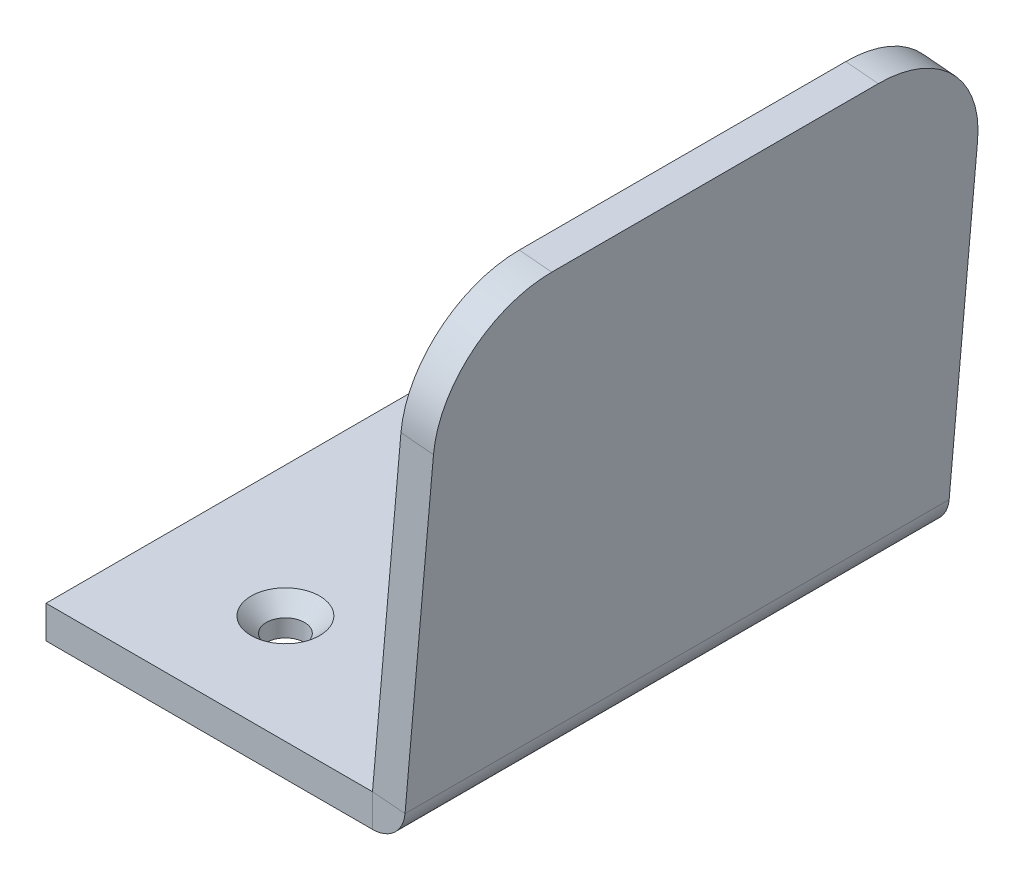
ISO-10303-21;
HEADER;
FILE_DESCRIPTION(('STEP AP214'),'2;1');
FILE_NAME('part.step','',(''),(''),'','','');
FILE_SCHEMA(('AUTOMOTIVE_DESIGN { 1 0 10303 214 1 1 1 1 }'));
ENDSEC;
DATA;
#1=APPLICATION_CONTEXT('core data for automotive mechanical design processes');
#2=APPLICATION_PROTOCOL_DEFINITION('international standard','automotive_design',2000,#1);
#3=PRODUCT_CONTEXT('',#1,'mechanical');
#4=PRODUCT('Part','Part','',(#3));
#5=PRODUCT_RELATED_PRODUCT_CATEGORY('part','',(#4));
#6=PRODUCT_DEFINITION_FORMATION('','',#4);
#7=PRODUCT_DEFINITION_CONTEXT('part definition',#1,'design');
#8=PRODUCT_DEFINITION('design','',#6,#7);
#9=PRODUCT_DEFINITION_SHAPE('','',#8);
#10=(LENGTH_UNIT() NAMED_UNIT(*) SI_UNIT(.MILLI.,.METRE.));
#11=(NAMED_UNIT(*) PLANE_ANGLE_UNIT() SI_UNIT($,.RADIAN.));
#12=(NAMED_UNIT(*) SI_UNIT($,.STERADIAN.) SOLID_ANGLE_UNIT());
#13=UNCERTAINTY_MEASURE_WITH_UNIT(LENGTH_MEASURE(1.E-05),#10,'distance_accuracy_value','');
#14=(GEOMETRIC_REPRESENTATION_CONTEXT(3) GLOBAL_UNCERTAINTY_ASSIGNED_CONTEXT((#13)) GLOBAL_UNIT_ASSIGNED_CONTEXT((#10,
#11,#12)) REPRESENTATION_CONTEXT('',''));
#15=CARTESIAN_POINT('',(0.,0.,0.));
#16=DIRECTION('',(0.,0.,1.));
#17=DIRECTION('',(1.,0.,0.));
#18=AXIS2_PLACEMENT_3D('',#15,#16,#17);
#19=CARTESIAN_POINT('',(35.6051299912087,32.6260905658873,-40.));
#20=DIRECTION('',(-0.996194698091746,0.087155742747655,0.));
#21=DIRECTION('',(0.,0.,1.));
#22=AXIS2_PLACEMENT_3D('',#19,#20,#21);
#23=PLANE('',#22);
#24=DIRECTION('',(0.087155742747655,0.996194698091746,0.));
#25=VECTOR('',#24,1.);
#26=CARTESIAN_POINT('',(30.3757854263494,-27.1455913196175,0.));
#27=LINE('',#26,#25);
#28=CARTESIAN_POINT('',(32.9911061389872,2.74766121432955,0.));
#29=VERTEX_POINT('',#28);
#30=CARTESIAN_POINT('',(35.6051299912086,32.6260905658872,0.));
#31=VERTEX_POINT('',#30);
#32=EDGE_CURVE('E54',#29,#31,#27,.T.);
#33=ORIENTED_EDGE('',*,*,#32,.F.);
#34=DIRECTION('',(0.,0.,-1.));
#35=VECTOR('',#34,1.);
#36=CARTESIAN_POINT('',(32.9911061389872,2.74766121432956,-40.));
#37=LINE('',#36,#35);
#38=CARTESIAN_POINT('',(32.9911061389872,2.74766121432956,-50.));
#39=VERTEX_POINT('',#38);
#40=EDGE_CURVE('E46',#29,#39,#37,.T.);
#41=ORIENTED_EDGE('',*,*,#40,.T.);
#42=DIRECTION('',(-0.087155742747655,-0.996194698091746,0.));
#43=VECTOR('',#42,1.);
#44=CARTESIAN_POINT('',(30.3757854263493,-27.1455913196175,-50.));
#45=LINE('',#44,#43);
#46=CARTESIAN_POINT('',(35.6051299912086,32.6260905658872,-50.));
#47=VERTEX_POINT('',#46);
#48=EDGE_CURVE('E61',#47,#39,#45,.T.);
#49=ORIENTED_EDGE('',*,*,#48,.F.);
#50=CARTESIAN_POINT('',(35.6051299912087,32.6260905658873,-40.));
#51=DIRECTION('',(-0.996194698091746,0.087155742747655,0.));
#52=DIRECTION('',(0.,0.,1.));
#53=AXIS2_PLACEMENT_3D('',#50,#51,#52);
#54=CIRCLE('',#53,9.99999999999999);
#55=CARTESIAN_POINT('',(36.4766874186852,42.5880375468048,-39.9999999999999));
#56=VERTEX_POINT('',#55);
#57=EDGE_CURVE('E206',#56,#47,#54,.T.);
#58=ORIENTED_EDGE('',*,*,#57,.F.);
#59=DIRECTION('',(0.,0.,-1.));
#60=VECTOR('',#59,1.);
#61=CARTESIAN_POINT('',(36.4766874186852,42.5880375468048,-10.0000000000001));
#62=LINE('',#61,#60);
#63=CARTESIAN_POINT('',(36.4766874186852,42.5880375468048,-10.0000000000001));
#64=VERTEX_POINT('',#63);
#65=EDGE_CURVE('E204',#64,#56,#62,.T.);
#66=ORIENTED_EDGE('',*,*,#65,.F.);
#67=CARTESIAN_POINT('',(35.6051299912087,32.6260905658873,-10.));
#68=DIRECTION('',(-0.996194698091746,0.087155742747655,0.));
#69=DIRECTION('',(0.,0.,1.));
#70=AXIS2_PLACEMENT_3D('',#67,#68,#69);
#71=CIRCLE('',#70,10.);
#72=EDGE_CURVE('E202',#31,#64,#71,.T.);
#73=ORIENTED_EDGE('',*,*,#72,.F.);
#74=EDGE_LOOP('',(#33,#41,#49,#58,#66,#73));
#75=FACE_BOUND('',#74,.T.);
#76=ADVANCED_FACE('F37',(#75),#23,.F.);
#77=CARTESIAN_POINT('',(27.3872013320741,-26.8841240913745,-50.));
#78=DIRECTION('',(0.,0.,1.));
#79=DIRECTION('',(0.087155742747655,0.996194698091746,0.));
#80=AXIS2_PLACEMENT_3D('',#77,#78,#79);
#81=PLANE('',#80);
#82=ORIENTED_EDGE('',*,*,#48,.T.);
#83=DIRECTION('',(-0.996194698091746,0.087155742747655,0.));
#84=VECTOR('',#83,1.);
#85=CARTESIAN_POINT('',(30.002522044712,3.00912844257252,-50.));
#86=LINE('',#85,#84);
#87=CARTESIAN_POINT('',(30.002522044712,3.00912844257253,-50.));
#88=VERTEX_POINT('',#87);
#89=EDGE_CURVE('E220',#39,#88,#86,.T.);
#90=ORIENTED_EDGE('',*,*,#89,.T.);
#91=DIRECTION('',(-0.087155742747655,-0.996194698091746,0.));
#92=VECTOR('',#91,1.);
#93=CARTESIAN_POINT('',(27.3872013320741,-26.8841240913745,-50.));
#94=LINE('',#93,#92);
#95=CARTESIAN_POINT('',(32.6165458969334,32.8875577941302,-50.));
#96=VERTEX_POINT('',#95);
#97=EDGE_CURVE('E201',#96,#88,#94,.T.);
#98=ORIENTED_EDGE('',*,*,#97,.F.);
#99=DIRECTION('',(0.996194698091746,-0.087155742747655,0.));
#100=VECTOR('',#99,1.);
#101=CARTESIAN_POINT('',(32.6165458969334,32.8875577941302,-50.));
#102=LINE('',#101,#100);
#103=EDGE_CURVE('E208',#96,#47,#102,.T.);
#104=ORIENTED_EDGE('',*,*,#103,.T.);
#105=EDGE_LOOP('',(#82,#90,#98,#104));
#106=FACE_BOUND('',#105,.T.);
#107=ADVANCED_FACE('F231',(#106),#81,.F.);
#108=CARTESIAN_POINT('',(27.3872013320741,-26.8841240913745,0.));
#109=DIRECTION('',(0.,0.,-1.));
#110=DIRECTION('',(-0.087155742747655,-0.996194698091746,0.));
#111=AXIS2_PLACEMENT_3D('',#108,#109,#110);
#112=PLANE('',#111);
#113=DIRECTION('',(0.087155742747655,0.996194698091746,0.));
#114=VECTOR('',#113,1.);
#115=CARTESIAN_POINT('',(27.3872013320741,-26.8841240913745,0.));
#116=LINE('',#115,#114);
#117=CARTESIAN_POINT('',(30.002522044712,3.00912844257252,0.));
#118=VERTEX_POINT('',#117);
#119=CARTESIAN_POINT('',(32.6165458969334,32.8875577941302,0.));
#120=VERTEX_POINT('',#119);
#121=EDGE_CURVE('E41',#118,#120,#116,.T.);
#122=ORIENTED_EDGE('',*,*,#121,.F.);
#123=DIRECTION('',(0.996194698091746,-0.087155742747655,0.));
#124=VECTOR('',#123,1.);
#125=CARTESIAN_POINT('',(30.002522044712,3.00912844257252,0.));
#126=LINE('',#125,#124);
#127=EDGE_CURVE('E12',#118,#29,#126,.T.);
#128=ORIENTED_EDGE('',*,*,#127,.T.);
#129=ORIENTED_EDGE('',*,*,#32,.T.);
#130=DIRECTION('',(0.996194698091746,-0.087155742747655,0.));
#131=VECTOR('',#130,1.);
#132=CARTESIAN_POINT('',(32.6165458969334,32.8875577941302,0.));
#133=LINE('',#132,#131);
#134=EDGE_CURVE('E216',#120,#31,#133,.T.);
#135=ORIENTED_EDGE('',*,*,#134,.F.);
#136=EDGE_LOOP('',(#122,#128,#129,#135));
#137=FACE_BOUND('',#136,.T.);
#138=ADVANCED_FACE('F39',(#137),#112,.F.);
#139=CARTESIAN_POINT('',(32.6165458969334,32.8875577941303,-10.));
#140=DIRECTION('',(0.996194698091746,-0.087155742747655,0.));
#141=DIRECTION('',(0.,0.,-1.));
#142=AXIS2_PLACEMENT_3D('',#139,#140,#141);
#143=CYLINDRICAL_SURFACE('',#142,10.);
#144=ORIENTED_EDGE('',*,*,#72,.T.);
#145=DIRECTION('',(0.996194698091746,-0.087155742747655,0.));
#146=VECTOR('',#145,1.);
#147=CARTESIAN_POINT('',(33.48810332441,42.8495047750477,-10.0000000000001));
#148=LINE('',#147,#146);
#149=CARTESIAN_POINT('',(33.48810332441,42.8495047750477,-10.0000000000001));
#150=VERTEX_POINT('',#149);
#151=EDGE_CURVE('E213',#150,#64,#148,.T.);
#152=ORIENTED_EDGE('',*,*,#151,.F.);
#153=CARTESIAN_POINT('',(32.6165458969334,32.8875577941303,-10.));
#154=DIRECTION('',(-0.996194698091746,0.087155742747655,0.));
#155=DIRECTION('',(0.,0.,1.));
#156=AXIS2_PLACEMENT_3D('',#153,#154,#155);
#157=CIRCLE('',#156,10.);
#158=EDGE_CURVE('E195',#120,#150,#157,.T.);
#159=ORIENTED_EDGE('',*,*,#158,.F.);
#160=ORIENTED_EDGE('',*,*,#134,.T.);
#161=EDGE_LOOP('',(#144,#152,#159,#160));
#162=FACE_BOUND('',#161,.T.);
#163=ADVANCED_FACE('F272',(#162),#143,.T.);
#164=CARTESIAN_POINT('',(33.48810332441,42.8495047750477,-10.0000000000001));
#165=DIRECTION('',(-0.087155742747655,-0.996194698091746,0.));
#166=DIRECTION('',(0.,0.,1.));
#167=AXIS2_PLACEMENT_3D('',#164,#165,#166);
#168=PLANE('',#167);
#169=ORIENTED_EDGE('',*,*,#65,.T.);
#170=DIRECTION('',(0.996194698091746,-0.087155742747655,0.));
#171=VECTOR('',#170,1.);
#172=CARTESIAN_POINT('',(33.48810332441,42.8495047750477,-39.9999999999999));
#173=LINE('',#172,#171);
#174=CARTESIAN_POINT('',(33.48810332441,42.8495047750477,-39.9999999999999));
#175=VERTEX_POINT('',#174);
#176=EDGE_CURVE('E210',#175,#56,#173,.T.);
#177=ORIENTED_EDGE('',*,*,#176,.F.);
#178=DIRECTION('',(0.,0.,-1.));
#179=VECTOR('',#178,1.);
#180=CARTESIAN_POINT('',(33.48810332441,42.8495047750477,-10.0000000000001));
#181=LINE('',#180,#179);
#182=EDGE_CURVE('E197',#150,#175,#181,.T.);
#183=ORIENTED_EDGE('',*,*,#182,.F.);
#184=ORIENTED_EDGE('',*,*,#151,.T.);
#185=EDGE_LOOP('',(#169,#177,#183,#184));
#186=FACE_BOUND('',#185,.T.);
#187=ADVANCED_FACE('F275',(#186),#168,.F.);
#188=CARTESIAN_POINT('',(32.6165458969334,32.8875577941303,-40.));
#189=DIRECTION('',(0.996194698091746,-0.087155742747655,0.));
#190=DIRECTION('',(0.,0.,-1.));
#191=AXIS2_PLACEMENT_3D('',#188,#189,#190);
#192=CYLINDRICAL_SURFACE('',#191,9.99999999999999);
#193=ORIENTED_EDGE('',*,*,#57,.T.);
#194=ORIENTED_EDGE('',*,*,#103,.F.);
#195=CARTESIAN_POINT('',(32.6165458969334,32.8875577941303,-40.));
#196=DIRECTION('',(-0.996194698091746,0.087155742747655,0.));
#197=DIRECTION('',(0.,0.,1.));
#198=AXIS2_PLACEMENT_3D('',#195,#196,#197);
#199=CIRCLE('',#198,9.99999999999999);
#200=EDGE_CURVE('E199',#175,#96,#199,.T.);
#201=ORIENTED_EDGE('',*,*,#200,.F.);
#202=ORIENTED_EDGE('',*,*,#176,.T.);
#203=EDGE_LOOP('',(#193,#194,#201,#202));
#204=FACE_BOUND('',#203,.T.);
#205=ADVANCED_FACE('F271',(#204),#192,.T.);
#206=CARTESIAN_POINT('',(32.6165458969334,32.8875577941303,-40.));
#207=DIRECTION('',(-0.996194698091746,0.087155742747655,0.));
#208=DIRECTION('',(0.,0.,1.));
#209=AXIS2_PLACEMENT_3D('',#206,#207,#208);
#210=PLANE('',#209);
#211=DIRECTION('',(0.,0.,-1.));
#212=VECTOR('',#211,1.);
#213=CARTESIAN_POINT('',(30.002522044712,3.00912844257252,-40.));
#214=LINE('',#213,#212);
#215=EDGE_CURVE('E152',#118,#88,#214,.T.);
#216=ORIENTED_EDGE('',*,*,#215,.F.);
#217=ORIENTED_EDGE('',*,*,#121,.T.);
#218=ORIENTED_EDGE('',*,*,#158,.T.);
#219=ORIENTED_EDGE('',*,*,#182,.T.);
#220=ORIENTED_EDGE('',*,*,#200,.T.);
#221=ORIENTED_EDGE('',*,*,#97,.T.);
#222=EDGE_LOOP('',(#216,#217,#218,#219,#220,#221));
#223=FACE_BOUND('',#222,.T.);
#224=ADVANCED_FACE('F227',(#223),#210,.T.);
#225=CARTESIAN_POINT('',(12.,3.,-10.));
#226=DIRECTION('',(0.,1.,0.));
#227=DIRECTION('',(0.,0.,1.));
#228=AXIS2_PLACEMENT_3D('',#225,#226,#227);
#229=CYLINDRICAL_SURFACE('',#228,1.75);
#230=CARTESIAN_POINT('',(12.,0.,-10.));
#231=DIRECTION('',(0.,1.,0.));
#232=DIRECTION('',(0.,0.,1.));
#233=AXIS2_PLACEMENT_3D('',#230,#231,#232);
#234=CIRCLE('',#233,1.75);
#235=CARTESIAN_POINT('',(12.,0.,-8.25));
#236=VERTEX_POINT('',#235);
#237=EDGE_CURVE('E169',#236,#236,#234,.T.);
#238=ORIENTED_EDGE('',*,*,#237,.F.);
#239=EDGE_LOOP('',(#238));
#240=FACE_BOUND('',#239,.T.);
#241=CARTESIAN_POINT('',(12.,1.6,-10.));
#242=DIRECTION('',(0.,1.,0.));
#243=DIRECTION('',(0.,0.,1.));
#244=AXIS2_PLACEMENT_3D('',#241,#242,#243);
#245=CIRCLE('',#244,1.75);
#246=CARTESIAN_POINT('',(12.,1.6,-8.25));
#247=VERTEX_POINT('',#246);
#248=EDGE_CURVE('E147',#247,#247,#245,.T.);
#249=ORIENTED_EDGE('',*,*,#248,.T.);
#250=EDGE_LOOP('',(#249));
#251=FACE_BOUND('',#250,.T.);
#252=ADVANCED_FACE('F260',(#240,#251),#229,.F.);
#253=CARTESIAN_POINT('',(12.,3.,-40.));
#254=DIRECTION('',(0.,1.,0.));
#255=DIRECTION('',(0.,0.,1.));
#256=AXIS2_PLACEMENT_3D('',#253,#254,#255);
#257=CYLINDRICAL_SURFACE('',#256,1.75);
#258=CARTESIAN_POINT('',(12.,0.,-40.));
#259=DIRECTION('',(0.,1.,0.));
#260=DIRECTION('',(0.,0.,1.));
#261=AXIS2_PLACEMENT_3D('',#258,#259,#260);
#262=CIRCLE('',#261,1.75);
#263=CARTESIAN_POINT('',(12.,0.,-38.25));
#264=VERTEX_POINT('',#263);
#265=EDGE_CURVE('E172',#264,#264,#262,.T.);
#266=ORIENTED_EDGE('',*,*,#265,.F.);
#267=EDGE_LOOP('',(#266));
#268=FACE_BOUND('',#267,.T.);
#269=CARTESIAN_POINT('',(12.,1.6,-40.));
#270=DIRECTION('',(0.,1.,0.));
#271=DIRECTION('',(0.,0.,1.));
#272=AXIS2_PLACEMENT_3D('',#269,#270,#271);
#273=CIRCLE('',#272,1.75);
#274=CARTESIAN_POINT('',(12.,1.6,-38.25));
#275=VERTEX_POINT('',#274);
#276=EDGE_CURVE('E189',#275,#275,#273,.T.);
#277=ORIENTED_EDGE('',*,*,#276,.T.);
#278=EDGE_LOOP('',(#277));
#279=FACE_BOUND('',#278,.T.);
#280=ADVANCED_FACE('F251',(#268,#279),#257,.F.);
#281=CARTESIAN_POINT('',(0.,3.,0.));
#282=DIRECTION('',(1.,0.,0.));
#283=DIRECTION('',(0.,0.,-1.));
#284=AXIS2_PLACEMENT_3D('',#281,#282,#283);
#285=PLANE('',#284);
#286=DIRECTION('',(0.,0.,1.));
#287=VECTOR('',#286,1.);
#288=CARTESIAN_POINT('',(0.,0.,0.));
#289=LINE('',#288,#287);
#290=CARTESIAN_POINT('',(0.,0.,-50.));
#291=VERTEX_POINT('',#290);
#292=CARTESIAN_POINT('',(0.,0.,0.));
#293=VERTEX_POINT('',#292);
#294=EDGE_CURVE('E186',#291,#293,#289,.T.);
#295=ORIENTED_EDGE('',*,*,#294,.T.);
#296=DIRECTION('',(0.,-1.,0.));
#297=VECTOR('',#296,1.);
#298=CARTESIAN_POINT('',(0.,3.,0.));
#299=LINE('',#298,#297);
#300=CARTESIAN_POINT('',(0.,3.,0.));
#301=VERTEX_POINT('',#300);
#302=EDGE_CURVE('E166',#301,#293,#299,.T.);
#303=ORIENTED_EDGE('',*,*,#302,.F.);
#304=DIRECTION('',(0.,0.,1.));
#305=VECTOR('',#304,1.);
#306=CARTESIAN_POINT('',(0.,3.,0.));
#307=LINE('',#306,#305);
#308=CARTESIAN_POINT('',(0.,3.,-50.));
#309=VERTEX_POINT('',#308);
#310=EDGE_CURVE('E127',#309,#301,#307,.T.);
#311=ORIENTED_EDGE('',*,*,#310,.F.);
#312=DIRECTION('',(0.,-1.,0.));
#313=VECTOR('',#312,1.);
#314=CARTESIAN_POINT('',(0.,3.,-50.));
#315=LINE('',#314,#313);
#316=EDGE_CURVE('E123',#309,#291,#315,.T.);
#317=ORIENTED_EDGE('',*,*,#316,.T.);
#318=EDGE_LOOP('',(#295,#303,#311,#317));
#319=FACE_BOUND('',#318,.T.);
#320=ADVANCED_FACE('F248',(#319),#285,.F.);
#321=CARTESIAN_POINT('',(12.,3.,-10.));
#322=DIRECTION('',(0.,1.,0.));
#323=DIRECTION('',(0.,0.,1.));
#324=AXIS2_PLACEMENT_3D('',#321,#322,#323);
#325=CONICAL_SURFACE('',#324,3.15,0.785398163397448);
#326=ORIENTED_EDGE('',*,*,#248,.F.);
#327=EDGE_LOOP('',(#326));
#328=FACE_BOUND('',#327,.T.);
#329=CARTESIAN_POINT('',(12.,3.,-10.));
#330=DIRECTION('',(0.,1.,0.));
#331=DIRECTION('',(0.,0.,1.));
#332=AXIS2_PLACEMENT_3D('',#329,#330,#331);
#333=CIRCLE('',#332,3.15);
#334=CARTESIAN_POINT('',(12.,3.,-6.85));
#335=VERTEX_POINT('',#334);
#336=EDGE_CURVE('E182',#335,#335,#333,.T.);
#337=ORIENTED_EDGE('',*,*,#336,.T.);
#338=EDGE_LOOP('',(#337));
#339=FACE_BOUND('',#338,.T.);
#340=ADVANCED_FACE('F250',(#328,#339),#325,.F.);
#341=CARTESIAN_POINT('',(12.,3.,-40.));
#342=DIRECTION('',(0.,1.,0.));
#343=DIRECTION('',(0.,0.,1.));
#344=AXIS2_PLACEMENT_3D('',#341,#342,#343);
#345=CONICAL_SURFACE('',#344,3.15,0.785398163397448);
#346=ORIENTED_EDGE('',*,*,#276,.F.);
#347=EDGE_LOOP('',(#346));
#348=FACE_BOUND('',#347,.T.);
#349=CARTESIAN_POINT('',(12.,3.,-40.));
#350=DIRECTION('',(0.,1.,0.));
#351=DIRECTION('',(0.,0.,1.));
#352=AXIS2_PLACEMENT_3D('',#349,#350,#351);
#353=CIRCLE('',#352,3.15);
#354=CARTESIAN_POINT('',(12.,3.,-36.85));
#355=VERTEX_POINT('',#354);
#356=EDGE_CURVE('E179',#355,#355,#353,.T.);
#357=ORIENTED_EDGE('',*,*,#356,.T.);
#358=EDGE_LOOP('',(#357));
#359=FACE_BOUND('',#358,.T.);
#360=ADVANCED_FACE('F257',(#348,#359),#345,.F.);
#361=CARTESIAN_POINT('',(60.,3.,-40.));
#362=DIRECTION('',(0.,1.,0.));
#363=DIRECTION('',(0.,0.,1.));
#364=AXIS2_PLACEMENT_3D('',#361,#362,#363);
#365=PLANE('',#364);
#366=ORIENTED_EDGE('',*,*,#356,.F.);
#367=EDGE_LOOP('',(#366));
#368=FACE_BOUND('',#367,.T.);
#369=ORIENTED_EDGE('',*,*,#336,.F.);
#370=EDGE_LOOP('',(#369));
#371=FACE_BOUND('',#370,.T.);
#372=DIRECTION('',(1.,0.,0.));
#373=VECTOR('',#372,1.);
#374=CARTESIAN_POINT('',(0.,3.,0.));
#375=LINE('',#374,#373);
#376=CARTESIAN_POINT('',(29.9925600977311,3.,0.));
#377=VERTEX_POINT('',#376);
#378=EDGE_CURVE('E132',#301,#377,#375,.T.);
#379=ORIENTED_EDGE('',*,*,#378,.T.);
#380=DIRECTION('',(0.,0.,-1.));
#381=VECTOR('',#380,1.);
#382=CARTESIAN_POINT('',(29.9925600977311,3.,-40.));
#383=LINE('',#382,#381);
#384=CARTESIAN_POINT('',(29.9925600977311,3.,-50.));
#385=VERTEX_POINT('',#384);
#386=EDGE_CURVE('E128',#377,#385,#383,.T.);
#387=ORIENTED_EDGE('',*,*,#386,.T.);
#388=DIRECTION('',(-1.,0.,0.));
#389=VECTOR('',#388,1.);
#390=CARTESIAN_POINT('',(0.,3.,-50.));
#391=LINE('',#390,#389);
#392=EDGE_CURVE('E116',#385,#309,#391,.T.);
#393=ORIENTED_EDGE('',*,*,#392,.T.);
#394=ORIENTED_EDGE('',*,*,#310,.T.);
#395=EDGE_LOOP('',(#379,#387,#393,#394));
#396=FACE_BOUND('',#395,.T.);
#397=ADVANCED_FACE('F131',(#368,#371,#396),#365,.T.);
#398=CARTESIAN_POINT('',(0.,3.,-50.));
#399=DIRECTION('',(0.,0.,1.));
#400=DIRECTION('',(1.,0.,0.));
#401=AXIS2_PLACEMENT_3D('',#398,#399,#400);
#402=PLANE('',#401);
#403=DIRECTION('',(0.,1.,0.));
#404=VECTOR('',#403,1.);
#405=CARTESIAN_POINT('',(29.9925600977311,3.,-50.));
#406=LINE('',#405,#404);
#407=CARTESIAN_POINT('',(29.9925600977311,0.,-50.));
#408=VERTEX_POINT('',#407);
#409=EDGE_CURVE('E120',#408,#385,#406,.T.);
#410=ORIENTED_EDGE('',*,*,#409,.F.);
#411=DIRECTION('',(-1.,0.,0.));
#412=VECTOR('',#411,1.);
#413=CARTESIAN_POINT('',(0.,0.,-50.));
#414=LINE('',#413,#412);
#415=EDGE_CURVE('E175',#408,#291,#414,.T.);
#416=ORIENTED_EDGE('',*,*,#415,.T.);
#417=ORIENTED_EDGE('',*,*,#316,.F.);
#418=ORIENTED_EDGE('',*,*,#392,.F.);
#419=EDGE_LOOP('',(#410,#416,#417,#418));
#420=FACE_BOUND('',#419,.T.);
#421=ADVANCED_FACE('F118',(#420),#402,.F.);
#422=CARTESIAN_POINT('',(60.,0.,-40.));
#423=DIRECTION('',(0.,1.,0.));
#424=DIRECTION('',(0.,0.,1.));
#425=AXIS2_PLACEMENT_3D('',#422,#423,#424);
#426=PLANE('',#425);
#427=DIRECTION('',(0.,0.,-1.));
#428=VECTOR('',#427,1.);
#429=CARTESIAN_POINT('',(29.9925600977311,0.,-40.));
#430=LINE('',#429,#428);
#431=CARTESIAN_POINT('',(29.9925600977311,0.,0.));
#432=VERTEX_POINT('',#431);
#433=EDGE_CURVE('E148',#432,#408,#430,.T.);
#434=ORIENTED_EDGE('',*,*,#433,.F.);
#435=DIRECTION('',(1.,0.,0.));
#436=VECTOR('',#435,1.);
#437=CARTESIAN_POINT('',(0.,0.,0.));
#438=LINE('',#437,#436);
#439=EDGE_CURVE('E164',#293,#432,#438,.T.);
#440=ORIENTED_EDGE('',*,*,#439,.F.);
#441=ORIENTED_EDGE('',*,*,#294,.F.);
#442=ORIENTED_EDGE('',*,*,#415,.F.);
#443=EDGE_LOOP('',(#434,#440,#441,#442));
#444=FACE_BOUND('',#443,.T.);
#445=ORIENTED_EDGE('',*,*,#265,.T.);
#446=EDGE_LOOP('',(#445));
#447=FACE_BOUND('',#446,.T.);
#448=ORIENTED_EDGE('',*,*,#237,.T.);
#449=EDGE_LOOP('',(#448));
#450=FACE_BOUND('',#449,.T.);
#451=ADVANCED_FACE('F238',(#444,#447,#450),#426,.F.);
#452=CARTESIAN_POINT('',(0.,3.,0.));
#453=DIRECTION('',(0.,0.,-1.));
#454=DIRECTION('',(-1.,0.,0.));
#455=AXIS2_PLACEMENT_3D('',#452,#453,#454);
#456=PLANE('',#455);
#457=DIRECTION('',(0.,-1.,0.));
#458=VECTOR('',#457,1.);
#459=CARTESIAN_POINT('',(29.9925600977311,3.,0.));
#460=LINE('',#459,#458);
#461=EDGE_CURVE('E153',#377,#432,#460,.T.);
#462=ORIENTED_EDGE('',*,*,#461,.F.);
#463=ORIENTED_EDGE('',*,*,#378,.F.);
#464=ORIENTED_EDGE('',*,*,#302,.T.);
#465=ORIENTED_EDGE('',*,*,#439,.T.);
#466=EDGE_LOOP('',(#462,#463,#464,#465));
#467=FACE_BOUND('',#466,.T.);
#468=ADVANCED_FACE('F245',(#467),#456,.F.);
#469=CARTESIAN_POINT('',(29.9925600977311,3.01,0.));
#470=DIRECTION('',(0.,0.,-1.));
#471=DIRECTION('',(-1.,0.,0.));
#472=AXIS2_PLACEMENT_3D('',#469,#470,#471);
#473=PLANE('',#472);
#474=ORIENTED_EDGE('',*,*,#461,.T.);
#475=CARTESIAN_POINT('',(29.9925600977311,3.01,0.));
#476=DIRECTION('',(0.,0.,-1.));
#477=DIRECTION('',(-1.,0.,0.));
#478=AXIS2_PLACEMENT_3D('',#475,#476,#477);
#479=CIRCLE('',#478,3.01);
#480=EDGE_CURVE('E160',#432,#29,#479,.F.);
#481=ORIENTED_EDGE('',*,*,#480,.T.);
#482=ORIENTED_EDGE('',*,*,#127,.F.);
#483=CARTESIAN_POINT('',(29.9925600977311,3.01,0.));
#484=DIRECTION('',(0.,0.,1.));
#485=DIRECTION('',(1.,0.,0.));
#486=AXIS2_PLACEMENT_3D('',#483,#484,#485);
#487=CIRCLE('',#486,0.00999999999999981);
#488=EDGE_CURVE('E154',#377,#118,#487,.T.);
#489=ORIENTED_EDGE('',*,*,#488,.F.);
#490=EDGE_LOOP('',(#474,#481,#482,#489));
#491=FACE_BOUND('',#490,.T.);
#492=ADVANCED_FACE('F242',(#491),#473,.F.);
#493=CARTESIAN_POINT('',(29.9925600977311,3.01,-50.));
#494=DIRECTION('',(0.,0.,1.));
#495=DIRECTION('',(1.,0.,0.));
#496=AXIS2_PLACEMENT_3D('',#493,#494,#495);
#497=PLANE('',#496);
#498=CARTESIAN_POINT('',(29.9925600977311,3.01,-49.9999999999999));
#499=DIRECTION('',(0.,0.,-1.));
#500=DIRECTION('',(-1.,0.,0.));
#501=AXIS2_PLACEMENT_3D('',#498,#499,#500);
#502=CIRCLE('',#501,3.01);
#503=EDGE_CURVE('E146',#39,#408,#502,.T.);
#504=ORIENTED_EDGE('',*,*,#503,.T.);
#505=ORIENTED_EDGE('',*,*,#409,.T.);
#506=CARTESIAN_POINT('',(29.9925600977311,3.01,-50.));
#507=DIRECTION('',(0.,0.,-1.));
#508=DIRECTION('',(-1.,0.,0.));
#509=AXIS2_PLACEMENT_3D('',#506,#507,#508);
#510=CIRCLE('',#509,0.00999999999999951);
#511=EDGE_CURVE('E144',#88,#385,#510,.T.);
#512=ORIENTED_EDGE('',*,*,#511,.F.);
#513=ORIENTED_EDGE('',*,*,#89,.F.);
#514=EDGE_LOOP('',(#504,#505,#512,#513));
#515=FACE_BOUND('',#514,.T.);
#516=ADVANCED_FACE('F142',(#515),#497,.F.);
#517=CARTESIAN_POINT('',(29.9925600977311,3.01,25.0899213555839));
#518=DIRECTION('',(0.,0.,-1.));
#519=DIRECTION('',(-1.,0.,0.));
#520=AXIS2_PLACEMENT_3D('',#517,#518,#519);
#521=CYLINDRICAL_SURFACE('',#520,0.01);
#522=ORIENTED_EDGE('',*,*,#215,.T.);
#523=ORIENTED_EDGE('',*,*,#511,.T.);
#524=ORIENTED_EDGE('',*,*,#386,.F.);
#525=ORIENTED_EDGE('',*,*,#488,.T.);
#526=EDGE_LOOP('',(#522,#523,#524,#525));
#527=FACE_BOUND('',#526,.T.);
#528=ADVANCED_FACE('F151',(#527),#521,.F.);
#529=CARTESIAN_POINT('',(29.9925600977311,3.01,25.0899213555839));
#530=DIRECTION('',(0.,0.,-1.));
#531=DIRECTION('',(-1.,0.,0.));
#532=AXIS2_PLACEMENT_3D('',#529,#530,#531);
#533=CYLINDRICAL_SURFACE('',#532,3.01);
#534=ORIENTED_EDGE('',*,*,#40,.F.);
#535=ORIENTED_EDGE('',*,*,#480,.F.);
#536=ORIENTED_EDGE('',*,*,#433,.T.);
#537=ORIENTED_EDGE('',*,*,#503,.F.);
#538=EDGE_LOOP('',(#534,#535,#536,#537));
#539=FACE_BOUND('',#538,.T.);
#540=ADVANCED_FACE('F234',(#539),#533,.T.);
#541=CLOSED_SHELL('',(#76,#107,#138,#163,#187,#205,#224,#252,#280,#320,#340,#360,#397,#421,#451,
#468,#492,#516,#528,#540));
#542=MANIFOLD_SOLID_BREP('B2',#541);
#543=ADVANCED_BREP_SHAPE_REPRESENTATION('',(#18,#542),#14);
#544=SHAPE_DEFINITION_REPRESENTATION(#9,#543);
ENDSEC;
END-ISO-10303-21;
